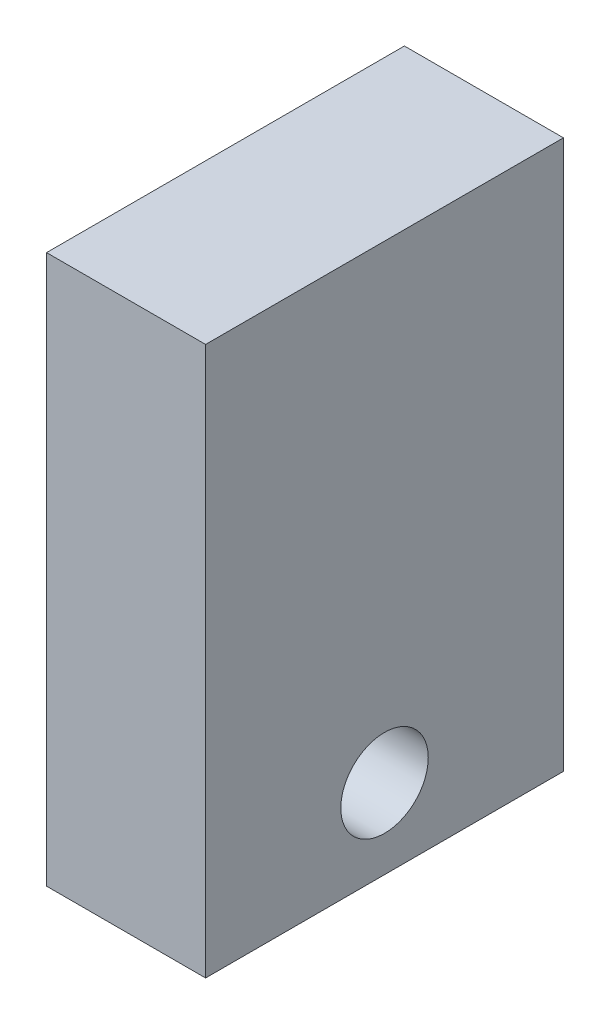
ISO-10303-21;
HEADER;
FILE_DESCRIPTION(('STEP AP214'),'2;1');
FILE_NAME('part.step','',(''),(''),'','','');
FILE_SCHEMA(('AUTOMOTIVE_DESIGN { 1 0 10303 214 1 1 1 1 }'));
ENDSEC;
DATA;
#1=APPLICATION_CONTEXT('core data for automotive mechanical design processes');
#2=APPLICATION_PROTOCOL_DEFINITION('international standard','automotive_design',2000,#1);
#3=PRODUCT_CONTEXT('',#1,'mechanical');
#4=PRODUCT('Part','Part','',(#3));
#5=PRODUCT_RELATED_PRODUCT_CATEGORY('part','',(#4));
#6=PRODUCT_DEFINITION_FORMATION('','',#4);
#7=PRODUCT_DEFINITION_CONTEXT('part definition',#1,'design');
#8=PRODUCT_DEFINITION('design','',#6,#7);
#9=PRODUCT_DEFINITION_SHAPE('','',#8);
#10=(LENGTH_UNIT() NAMED_UNIT(*) SI_UNIT(.MILLI.,.METRE.));
#11=(NAMED_UNIT(*) PLANE_ANGLE_UNIT() SI_UNIT($,.RADIAN.));
#12=(NAMED_UNIT(*) SI_UNIT($,.STERADIAN.) SOLID_ANGLE_UNIT());
#13=UNCERTAINTY_MEASURE_WITH_UNIT(LENGTH_MEASURE(1.E-05),#10,'distance_accuracy_value','');
#14=(GEOMETRIC_REPRESENTATION_CONTEXT(3) GLOBAL_UNCERTAINTY_ASSIGNED_CONTEXT((#13)) GLOBAL_UNIT_ASSIGNED_CONTEXT((#10,
#11,#12)) REPRESENTATION_CONTEXT('',''));
#15=CARTESIAN_POINT('',(0.,0.,0.));
#16=DIRECTION('',(0.,0.,1.));
#17=DIRECTION('',(1.,0.,0.));
#18=AXIS2_PLACEMENT_3D('',#15,#16,#17);
#19=CARTESIAN_POINT('',(30.,439.448231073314,-441.15500145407));
#20=DIRECTION('',(0.,0.,-1.));
#21=DIRECTION('',(-1.,0.,0.));
#22=AXIS2_PLACEMENT_3D('',#19,#20,#21);
#23=PLANE('',#22);
#24=DIRECTION('',(0.,-1.,0.));
#25=VECTOR('',#24,1.);
#26=CARTESIAN_POINT('',(30.,301.448231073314,-441.15500145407));
#27=LINE('',#26,#25);
#28=CARTESIAN_POINT('',(30.,439.448231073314,-441.15500145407));
#29=VERTEX_POINT('',#28);
#30=CARTESIAN_POINT('',(30.,301.448231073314,-441.15500145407));
#31=VERTEX_POINT('',#30);
#32=EDGE_CURVE('E80',#29,#31,#27,.T.);
#33=ORIENTED_EDGE('',*,*,#32,.F.);
#34=DIRECTION('',(-1.,0.,0.));
#35=VECTOR('',#34,1.);
#36=CARTESIAN_POINT('',(30.,439.448231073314,-441.15500145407));
#37=LINE('',#36,#35);
#38=CARTESIAN_POINT('',(70.,439.448231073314,-441.15500145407));
#39=VERTEX_POINT('',#38);
#40=EDGE_CURVE('E95',#39,#29,#37,.T.);
#41=ORIENTED_EDGE('',*,*,#40,.F.);
#42=DIRECTION('',(0.,1.,0.));
#43=VECTOR('',#42,1.);
#44=CARTESIAN_POINT('',(70.,301.448231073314,-441.15500145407));
#45=LINE('',#44,#43);
#46=CARTESIAN_POINT('',(70.,301.448231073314,-441.15500145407));
#47=VERTEX_POINT('',#46);
#48=EDGE_CURVE('E82',#47,#39,#45,.T.);
#49=ORIENTED_EDGE('',*,*,#48,.F.);
#50=DIRECTION('',(1.,0.,0.));
#51=VECTOR('',#50,1.);
#52=CARTESIAN_POINT('',(30.,301.448231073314,-441.15500145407));
#53=LINE('',#52,#51);
#54=EDGE_CURVE('E72',#31,#47,#53,.T.);
#55=ORIENTED_EDGE('',*,*,#54,.F.);
#56=EDGE_LOOP('',(#33,#41,#49,#55));
#57=FACE_BOUND('',#56,.T.);
#58=ADVANCED_FACE('F31',(#57),#23,.T.);
#59=CARTESIAN_POINT('',(30.,439.448231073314,-207.474801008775));
#60=DIRECTION('',(0.,-1.,0.));
#61=DIRECTION('',(0.,0.,-1.));
#62=AXIS2_PLACEMENT_3D('',#59,#60,#61);
#63=PLANE('',#62);
#64=DIRECTION('',(0.,0.,-1.));
#65=VECTOR('',#64,1.);
#66=CARTESIAN_POINT('',(30.,439.448231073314,-207.474801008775));
#67=LINE('',#66,#65);
#68=CARTESIAN_POINT('',(30.,439.448231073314,-351.15500145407));
#69=VERTEX_POINT('',#68);
#70=EDGE_CURVE('E85',#69,#29,#67,.T.);
#71=ORIENTED_EDGE('',*,*,#70,.F.);
#72=DIRECTION('',(1.,0.,0.));
#73=VECTOR('',#72,1.);
#74=CARTESIAN_POINT('',(30.,439.448231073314,-351.15500145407));
#75=LINE('',#74,#73);
#76=CARTESIAN_POINT('',(70.,439.448231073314,-351.15500145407));
#77=VERTEX_POINT('',#76);
#78=EDGE_CURVE('E35',#69,#77,#75,.T.);
#79=ORIENTED_EDGE('',*,*,#78,.T.);
#80=DIRECTION('',(0.,0.,-1.));
#81=VECTOR('',#80,1.);
#82=CARTESIAN_POINT('',(70.,439.448231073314,-207.474801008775));
#83=LINE('',#82,#81);
#84=EDGE_CURVE('E98',#77,#39,#83,.T.);
#85=ORIENTED_EDGE('',*,*,#84,.T.);
#86=ORIENTED_EDGE('',*,*,#40,.T.);
#87=EDGE_LOOP('',(#71,#79,#85,#86));
#88=FACE_BOUND('',#87,.T.);
#89=ADVANCED_FACE('F114',(#88),#63,.F.);
#90=CARTESIAN_POINT('',(70.,301.448231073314,-207.474801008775));
#91=DIRECTION('',(-1.,0.,0.));
#92=DIRECTION('',(0.,0.,1.));
#93=AXIS2_PLACEMENT_3D('',#90,#91,#92);
#94=PLANE('',#93);
#95=CARTESIAN_POINT('',(70.,321.448231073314,-396.15500145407));
#96=DIRECTION('',(1.,0.,0.));
#97=DIRECTION('',(0.,0.,-1.));
#98=AXIS2_PLACEMENT_3D('',#95,#96,#97);
#99=CIRCLE('',#98,11.);
#100=CARTESIAN_POINT('',(70.,321.448231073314,-407.15500145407));
#101=VERTEX_POINT('',#100);
#102=EDGE_CURVE('E90',#101,#101,#99,.T.);
#103=ORIENTED_EDGE('',*,*,#102,.F.);
#104=EDGE_LOOP('',(#103));
#105=FACE_BOUND('',#104,.T.);
#106=ORIENTED_EDGE('',*,*,#84,.F.);
#107=DIRECTION('',(0.,-1.,0.));
#108=VECTOR('',#107,1.);
#109=CARTESIAN_POINT('',(70.,301.448231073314,-351.15500145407));
#110=LINE('',#109,#108);
#111=CARTESIAN_POINT('',(70.,301.448231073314,-351.15500145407));
#112=VERTEX_POINT('',#111);
#113=EDGE_CURVE('E104',#77,#112,#110,.T.);
#114=ORIENTED_EDGE('',*,*,#113,.T.);
#115=DIRECTION('',(0.,0.,-1.));
#116=VECTOR('',#115,1.);
#117=CARTESIAN_POINT('',(70.,301.448231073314,-207.474801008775));
#118=LINE('',#117,#116);
#119=EDGE_CURVE('E76',#112,#47,#118,.T.);
#120=ORIENTED_EDGE('',*,*,#119,.T.);
#121=ORIENTED_EDGE('',*,*,#48,.T.);
#122=EDGE_LOOP('',(#106,#114,#120,#121));
#123=FACE_BOUND('',#122,.T.);
#124=ADVANCED_FACE('F103',(#105,#123),#94,.F.);
#125=CARTESIAN_POINT('',(30.,301.448231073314,-207.474801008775));
#126=DIRECTION('',(0.,1.,0.));
#127=DIRECTION('',(0.,0.,1.));
#128=AXIS2_PLACEMENT_3D('',#125,#126,#127);
#129=PLANE('',#128);
#130=ORIENTED_EDGE('',*,*,#119,.F.);
#131=DIRECTION('',(-1.,0.,0.));
#132=VECTOR('',#131,1.);
#133=CARTESIAN_POINT('',(30.,301.448231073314,-351.15500145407));
#134=LINE('',#133,#132);
#135=CARTESIAN_POINT('',(30.,301.448231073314,-351.15500145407));
#136=VERTEX_POINT('',#135);
#137=EDGE_CURVE('E40',#112,#136,#134,.T.);
#138=ORIENTED_EDGE('',*,*,#137,.T.);
#139=DIRECTION('',(0.,0.,-1.));
#140=VECTOR('',#139,1.);
#141=CARTESIAN_POINT('',(30.,301.448231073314,-207.474801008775));
#142=LINE('',#141,#140);
#143=EDGE_CURVE('E69',#136,#31,#142,.T.);
#144=ORIENTED_EDGE('',*,*,#143,.T.);
#145=ORIENTED_EDGE('',*,*,#54,.T.);
#146=EDGE_LOOP('',(#130,#138,#144,#145));
#147=FACE_BOUND('',#146,.T.);
#148=ADVANCED_FACE('F71',(#147),#129,.F.);
#149=CARTESIAN_POINT('',(30.,301.448231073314,-207.474801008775));
#150=DIRECTION('',(1.,0.,0.));
#151=DIRECTION('',(0.,0.,-1.));
#152=AXIS2_PLACEMENT_3D('',#149,#150,#151);
#153=PLANE('',#152);
#154=CARTESIAN_POINT('',(30.,321.448231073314,-396.15500145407));
#155=DIRECTION('',(1.,0.,0.));
#156=DIRECTION('',(0.,0.,-1.));
#157=AXIS2_PLACEMENT_3D('',#154,#155,#156);
#158=CIRCLE('',#157,11.);
#159=CARTESIAN_POINT('',(30.,321.448231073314,-407.15500145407));
#160=VERTEX_POINT('',#159);
#161=EDGE_CURVE('E87',#160,#160,#158,.T.);
#162=ORIENTED_EDGE('',*,*,#161,.T.);
#163=EDGE_LOOP('',(#162));
#164=FACE_BOUND('',#163,.T.);
#165=ORIENTED_EDGE('',*,*,#143,.F.);
#166=DIRECTION('',(0.,1.,0.));
#167=VECTOR('',#166,1.);
#168=CARTESIAN_POINT('',(30.,301.448231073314,-351.15500145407));
#169=LINE('',#168,#167);
#170=EDGE_CURVE('E11',#136,#69,#169,.T.);
#171=ORIENTED_EDGE('',*,*,#170,.T.);
#172=ORIENTED_EDGE('',*,*,#70,.T.);
#173=ORIENTED_EDGE('',*,*,#32,.T.);
#174=EDGE_LOOP('',(#165,#171,#172,#173));
#175=FACE_BOUND('',#174,.T.);
#176=ADVANCED_FACE('F33',(#164,#175),#153,.F.);
#177=CARTESIAN_POINT('',(160.,449.448231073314,-351.15500145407));
#178=DIRECTION('',(0.,0.,-1.));
#179=DIRECTION('',(0.,1.,0.));
#180=AXIS2_PLACEMENT_3D('',#177,#178,#179);
#181=PLANE('',#180);
#182=ORIENTED_EDGE('',*,*,#137,.F.);
#183=ORIENTED_EDGE('',*,*,#113,.F.);
#184=ORIENTED_EDGE('',*,*,#78,.F.);
#185=ORIENTED_EDGE('',*,*,#170,.F.);
#186=EDGE_LOOP('',(#182,#183,#184,#185));
#187=FACE_BOUND('',#186,.T.);
#188=ADVANCED_FACE('F127',(#187),#181,.F.);
#189=CARTESIAN_POINT('',(70.,321.448231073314,-396.15500145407));
#190=DIRECTION('',(1.,0.,0.));
#191=DIRECTION('',(0.,0.,-1.));
#192=AXIS2_PLACEMENT_3D('',#189,#190,#191);
#193=CYLINDRICAL_SURFACE('',#192,11.);
#194=ORIENTED_EDGE('',*,*,#161,.F.);
#195=EDGE_LOOP('',(#194));
#196=FACE_BOUND('',#195,.T.);
#197=ORIENTED_EDGE('',*,*,#102,.T.);
#198=EDGE_LOOP('',(#197));
#199=FACE_BOUND('',#198,.T.);
#200=ADVANCED_FACE('F111',(#196,#199),#193,.F.);
#201=CLOSED_SHELL('',(#58,#89,#124,#148,#176,#188,#200));
#202=MANIFOLD_SOLID_BREP('B2',#201);
#203=ADVANCED_BREP_SHAPE_REPRESENTATION('',(#18,#202),#14);
#204=SHAPE_DEFINITION_REPRESENTATION(#9,#203);
ENDSEC;
END-ISO-10303-21;
